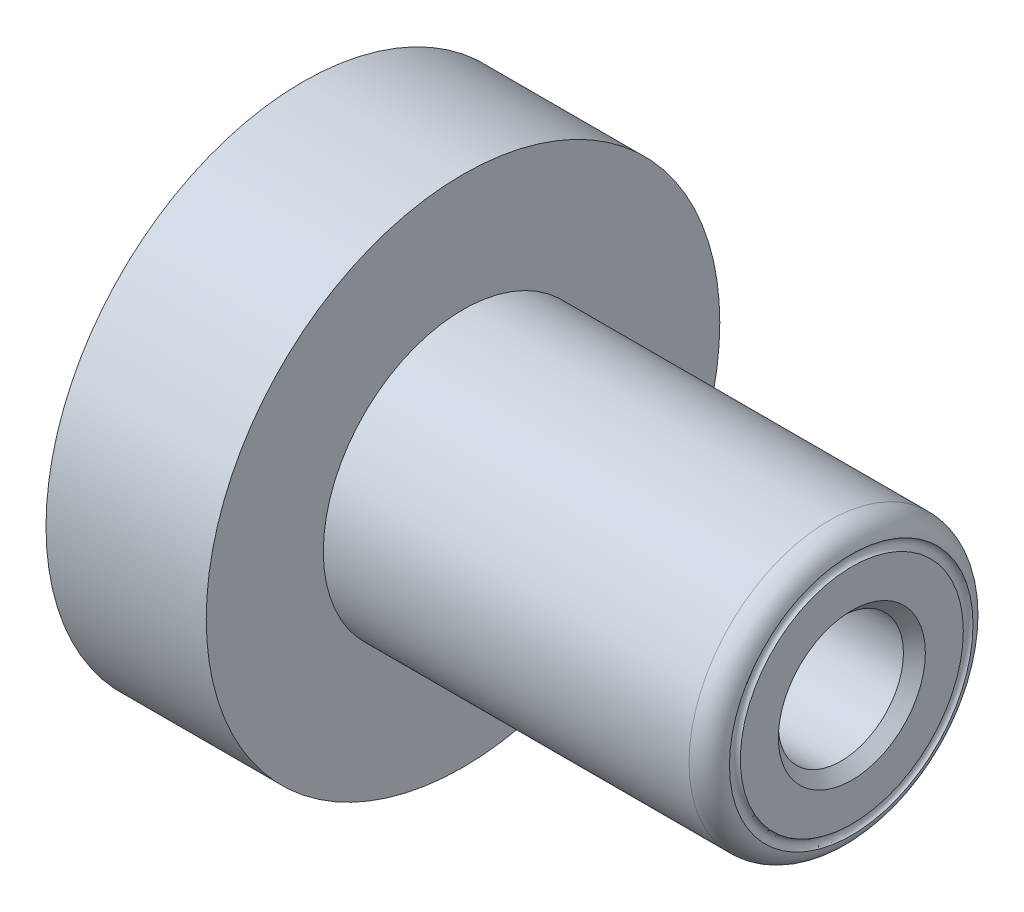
from build123d import *

# Parameters (mm, degrees)
SKETCH2_R          = 1.6129
CUT_EXTRUDE1_DEPTH = 6.35
SKETCH3_R          = 4.255
CUT_EXTRUDE2_DEPTH = 45.766103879
CHAMFER1_SIZE      = 0.745
SKETCH4_R          = 0.381


with BuildPart() as part:
    # Sketch1 → Revolve1 (revolve)
    with BuildSketch(Plane.XY, mode=Mode.PRIVATE) as revolve1_sk:
        with BuildLine():
            Line((0, 6.7437), (0, 17.4625))
            Line((0, 17.4625), (10.8966, 17.4625))
            Line((10.8966, 17.4625), (10.8966, 9.4996))
            Line((10.8966, 9.4996), (35.768, 9.4996))
            ThreePointArc((35.768, 9.4996), (36.878157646, 9.039757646), (37.338, 7.9296))
            Line((37.338, 7.9296), (37.338, 0))
            Line((37.338, 0), (20.447, 0))
            Line((20.447, 0), (20.447, 6.7437))
            Line((20.447, 6.7437), (0, 6.7437))
        make_face()
    revolve(revolve1_sk.sketch.rotate(Axis((0, 0, 0), (1, 0, 0)), 90), axis=Axis((0, 0, 0), (1, 0, 0)))

    # Sketch2 → Cut-Extrude1 (cut)
    with BuildSketch(Plane.ZY):
        with Locations((-11.1125, 0)):
            Circle(SKETCH2_R)
        with Locations(Location((11.1125, 0, 0), (0, 0, 180))):
            Circle(SKETCH2_R)
    extrude(amount=-CUT_EXTRUDE1_DEPTH, mode=Mode.SUBTRACT)

    # Sketch3 → Cut-Extrude2 (cut, through all)
    with BuildSketch(Plane(origin=(37.338, 0, 0), x_dir=(0, 0, -1), z_dir=(1, 0, 0))):
        Circle(SKETCH3_R)
    extrude(amount=-CUT_EXTRUDE2_DEPTH, mode=Mode.SUBTRACT)

    # Chamfer1
    chamfer1_edges = [part.edges().sort_by_distance(p)[0] for p in [
        (37.338, 0, 4.255),
    ]]
    chamfer(chamfer1_edges, length=CHAMFER1_SIZE)

    # Sketch4 → Cut-Revolve1 (revolve, cut)
    with BuildSketch(Plane.XY, mode=Mode.PRIVATE) as cut_revolve1_sk:
        with Locations((37.467, 7.94)):
            Circle(SKETCH4_R)
    revolve(cut_revolve1_sk.sketch.rotate(Axis((0, 0, 0), (1, 0, 0)), 90), axis=Axis((0, 0, 0), (1, 0, 0)), mode=Mode.SUBTRACT)


solid = part.part
